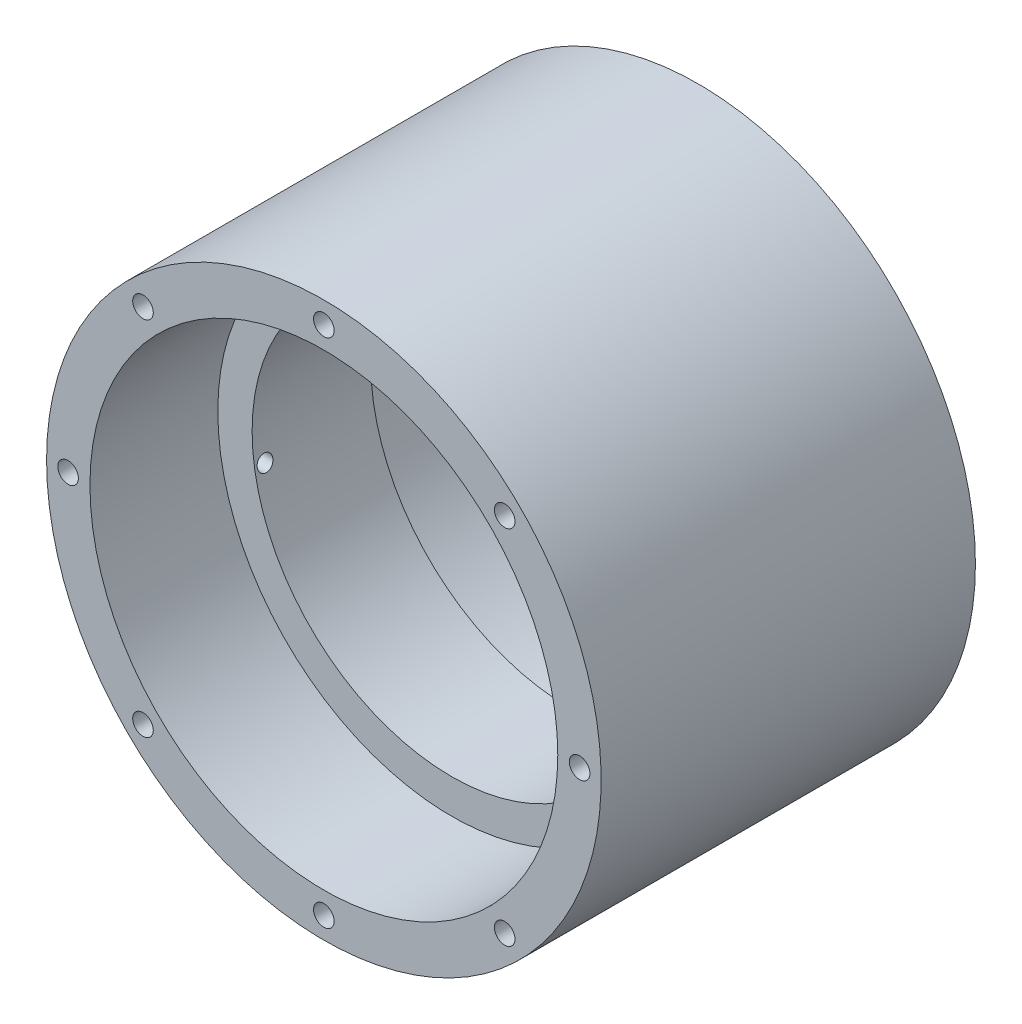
from build123d import *

# Parameters (mm, degrees)
SKETCH1_W                  = 44.45
SKETCH1_H                  = 60
CUT_EXTRUDE1_START         = -50
CUT_EXTRUDE1_DEPTH         = 50
F_4_CLEARANCE_HOLE1_D      = 3.3
F_4_CLEARANCE_HOLE1_DEPTH  = 8
F_2_CLEARANCE_HOLE1_REACH  = 117.544
F_2_CLEARANCE_HOLE1_BORE_R = 1.25
F_2_CLEARANCE_HOLE2_REACH  = 117.544
F_2_CLEARANCE_HOLE2_BORE_R = 1.25


with BuildPart() as part:
    # Sketch1 → Revolve1 (revolve)
    with BuildSketch(Plane.XZ, mode=Mode.PRIVATE) as revolve1_sk:
        with Locations((22.225, 30)):
            Rectangle(SKETCH1_W, SKETCH1_H)
    revolve(revolve1_sk.sketch.rotate(Axis((0, 0, 60), (0, 0, -1)), 180), axis=Axis((0, 0, 60), (0, 0, -1)))

    # Sketch2 → Cut-Extrude1 (cut)
    with BuildSketch(Plane(origin=(0, 0, 0), x_dir=(-1, 0, 0), z_dir=(0, 0, -1)).offset(CUT_EXTRUDE1_START)):
        with BuildLine():
            Line((43.7241638, 8), (43.7241638, -8))
            ThreePointArc((43.7241638, -8), (44.45, 0), (43.7241638, 8))
        make_face()
    extrude(amount=CUT_EXTRUDE1_DEPTH, mode=Mode.SUBTRACT)

    # Sketch3 → Cut-Revolve1 (revolve, cut)
    with BuildSketch(Plane.XZ, mode=Mode.PRIVATE) as cut_revolve1_sk:
        Polygon((37.5, 60), (0, 60), (0, 0), (37.5, 0), (37.5, 20.5), (32, 20.5), (32, 39.5), (37.5, 39.5), align=None)
    revolve(cut_revolve1_sk.sketch.rotate(Axis((0, 0, 60), (0, 0, -1)), 180), axis=Axis((0, 0, 60), (0, 0, -1)), mode=Mode.SUBTRACT)

    # 4 Clearance Hole1
    with Locations(Plane.XY.offset(60)):
        with Locations((28.991378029, 28.991378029), (0, 41), (-28.991378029, 28.991378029), (-41, 0), (-28.991378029, -28.991378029), (0, -41), (28.991378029, -28.991378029), (41, 0)):
            Hole(F_4_CLEARANCE_HOLE1_D / 2, depth=F_4_CLEARANCE_HOLE1_DEPTH)

    # 2 Clearance Hole1 bore → 2 Clearance Hole1 (cut, up to next)
    with BuildSketch(Plane.ZY.offset(43.7241638), mode=Mode.PRIVATE) as f_2_clearance_hole1_sk1:
        with Locations((15.584748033, 5.15)):
            Circle(F_2_CLEARANCE_HOLE1_BORE_R)
    f_2_clearance_hole1_tool1 = extrude(f_2_clearance_hole1_sk1.sketch, amount=-F_2_CLEARANCE_HOLE1_REACH, mode=Mode.PRIVATE) & part.part
    add(f_2_clearance_hole1_tool1.solids().sort_by_distance((-43.724164, 5.15, 15.584748))[0], mode=Mode.SUBTRACT)

    # 2 Clearance Hole2 bore → 2 Clearance Hole2 (cut, up to next)
    with BuildSketch(Plane.ZY.offset(43.7241638), mode=Mode.PRIVATE) as f_2_clearance_hole2_sk1:
        with Locations((37.834748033, -5.05)):
            Circle(F_2_CLEARANCE_HOLE2_BORE_R)
    f_2_clearance_hole2_tool1 = extrude(f_2_clearance_hole2_sk1.sketch, amount=-F_2_CLEARANCE_HOLE2_REACH, mode=Mode.PRIVATE) & part.part
    add(f_2_clearance_hole2_tool1.solids().sort_by_distance((-43.724164, -5.05, 37.834748))[0], mode=Mode.SUBTRACT)


solid = part.part
